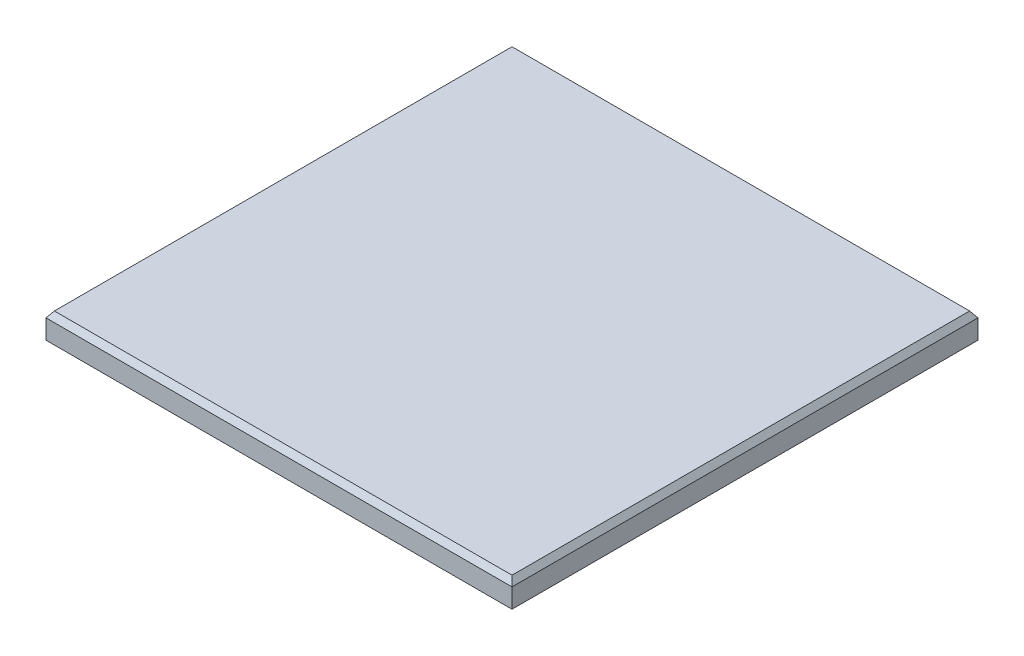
ISO-10303-21;
HEADER;
FILE_DESCRIPTION(('STEP AP214'),'2;1');
FILE_NAME('part.step','',(''),(''),'','','');
FILE_SCHEMA(('AUTOMOTIVE_DESIGN { 1 0 10303 214 1 1 1 1 }'));
ENDSEC;
DATA;
#1=APPLICATION_CONTEXT('core data for automotive mechanical design processes');
#2=APPLICATION_PROTOCOL_DEFINITION('international standard','automotive_design',2000,#1);
#3=PRODUCT_CONTEXT('',#1,'mechanical');
#4=PRODUCT('Part','Part','',(#3));
#5=PRODUCT_RELATED_PRODUCT_CATEGORY('part','',(#4));
#6=PRODUCT_DEFINITION_FORMATION('','',#4);
#7=PRODUCT_DEFINITION_CONTEXT('part definition',#1,'design');
#8=PRODUCT_DEFINITION('design','',#6,#7);
#9=PRODUCT_DEFINITION_SHAPE('','',#8);
#10=(LENGTH_UNIT() NAMED_UNIT(*) SI_UNIT(.MILLI.,.METRE.));
#11=(NAMED_UNIT(*) PLANE_ANGLE_UNIT() SI_UNIT($,.RADIAN.));
#12=(NAMED_UNIT(*) SI_UNIT($,.STERADIAN.) SOLID_ANGLE_UNIT());
#13=UNCERTAINTY_MEASURE_WITH_UNIT(LENGTH_MEASURE(1.E-05),#10,'distance_accuracy_value','');
#14=(GEOMETRIC_REPRESENTATION_CONTEXT(3) GLOBAL_UNCERTAINTY_ASSIGNED_CONTEXT((#13)) GLOBAL_UNIT_ASSIGNED_CONTEXT((#10,
#11,#12)) REPRESENTATION_CONTEXT('',''));
#15=CARTESIAN_POINT('',(0.,0.,0.));
#16=DIRECTION('',(0.,0.,1.));
#17=DIRECTION('',(1.,0.,0.));
#18=AXIS2_PLACEMENT_3D('',#15,#16,#17);
#19=CARTESIAN_POINT('',(-9.75,0.5,9.5));
#20=DIRECTION('',(0.,0.,-1.));
#21=DIRECTION('',(-1.,0.,0.));
#22=AXIS2_PLACEMENT_3D('',#19,#20,#21);
#23=PLANE('',#22);
#24=DIRECTION('',(0.,-1.,0.));
#25=VECTOR('',#24,1.);
#26=CARTESIAN_POINT('',(9.75,0.5,9.5));
#27=LINE('',#26,#25);
#28=CARTESIAN_POINT('',(9.75,0.25,9.5));
#29=VERTEX_POINT('',#28);
#30=CARTESIAN_POINT('',(9.75,-0.56,9.5));
#31=VERTEX_POINT('',#30);
#32=EDGE_CURVE('E122',#29,#31,#27,.T.);
#33=ORIENTED_EDGE('',*,*,#32,.F.);
#34=DIRECTION('',(-1.,0.,0.));
#35=VECTOR('',#34,1.);
#36=CARTESIAN_POINT('',(-9.75,0.25,9.5));
#37=LINE('',#36,#35);
#38=CARTESIAN_POINT('',(-9.75,0.25,9.5));
#39=VERTEX_POINT('',#38);
#40=EDGE_CURVE('E52',#29,#39,#37,.T.);
#41=ORIENTED_EDGE('',*,*,#40,.T.);
#42=DIRECTION('',(0.,-1.,0.));
#43=VECTOR('',#42,1.);
#44=CARTESIAN_POINT('',(-9.75,0.5,9.5));
#45=LINE('',#44,#43);
#46=CARTESIAN_POINT('',(-9.75,-0.56,9.5));
#47=VERTEX_POINT('',#46);
#48=EDGE_CURVE('E125',#39,#47,#45,.T.);
#49=ORIENTED_EDGE('',*,*,#48,.T.);
#50=DIRECTION('',(1.,0.,0.));
#51=VECTOR('',#50,1.);
#52=CARTESIAN_POINT('',(-9.75,-0.56,9.5));
#53=LINE('',#52,#51);
#54=EDGE_CURVE('E112',#47,#31,#53,.T.);
#55=ORIENTED_EDGE('',*,*,#54,.T.);
#56=EDGE_LOOP('',(#33,#41,#49,#55));
#57=FACE_BOUND('',#56,.T.);
#58=ADVANCED_FACE('F42',(#57),#23,.F.);
#59=CARTESIAN_POINT('',(-9.75,0.5,-10.));
#60=DIRECTION('',(0.,0.,1.));
#61=DIRECTION('',(1.,0.,0.));
#62=AXIS2_PLACEMENT_3D('',#59,#60,#61);
#63=PLANE('',#62);
#64=DIRECTION('',(0.,-1.,0.));
#65=VECTOR('',#64,1.);
#66=CARTESIAN_POINT('',(-9.75,0.5,-10.));
#67=LINE('',#66,#65);
#68=CARTESIAN_POINT('',(-9.75,0.25,-10.));
#69=VERTEX_POINT('',#68);
#70=CARTESIAN_POINT('',(-9.75,-0.56,-10.));
#71=VERTEX_POINT('',#70);
#72=EDGE_CURVE('E98',#69,#71,#67,.T.);
#73=ORIENTED_EDGE('',*,*,#72,.F.);
#74=DIRECTION('',(1.,0.,0.));
#75=VECTOR('',#74,1.);
#76=CARTESIAN_POINT('',(9.75,0.25,-10.));
#77=LINE('',#76,#75);
#78=CARTESIAN_POINT('',(9.75,0.25,-10.));
#79=VERTEX_POINT('',#78);
#80=EDGE_CURVE('E139',#69,#79,#77,.T.);
#81=ORIENTED_EDGE('',*,*,#80,.T.);
#82=DIRECTION('',(0.,-1.,0.));
#83=VECTOR('',#82,1.);
#84=CARTESIAN_POINT('',(9.75,0.5,-10.));
#85=LINE('',#84,#83);
#86=CARTESIAN_POINT('',(9.75,-0.56,-10.));
#87=VERTEX_POINT('',#86);
#88=EDGE_CURVE('E92',#79,#87,#85,.T.);
#89=ORIENTED_EDGE('',*,*,#88,.T.);
#90=DIRECTION('',(-1.,0.,0.));
#91=VECTOR('',#90,1.);
#92=CARTESIAN_POINT('',(-9.75,-0.56,-10.));
#93=LINE('',#92,#91);
#94=EDGE_CURVE('E46',#87,#71,#93,.T.);
#95=ORIENTED_EDGE('',*,*,#94,.T.);
#96=EDGE_LOOP('',(#73,#81,#89,#95));
#97=FACE_BOUND('',#96,.T.);
#98=ADVANCED_FACE('F106',(#97),#63,.F.);
#99=CARTESIAN_POINT('',(9.75,0.5,-9.75));
#100=DIRECTION('',(-1.,0.,0.));
#101=DIRECTION('',(0.,0.,1.));
#102=AXIS2_PLACEMENT_3D('',#99,#100,#101);
#103=PLANE('',#102);
#104=ORIENTED_EDGE('',*,*,#88,.F.);
#105=DIRECTION('',(0.,0.,1.));
#106=VECTOR('',#105,1.);
#107=CARTESIAN_POINT('',(9.75,0.25,9.75));
#108=LINE('',#107,#106);
#109=EDGE_CURVE('E124',#79,#29,#108,.T.);
#110=ORIENTED_EDGE('',*,*,#109,.T.);
#111=ORIENTED_EDGE('',*,*,#32,.T.);
#112=DIRECTION('',(0.,0.,-1.));
#113=VECTOR('',#112,1.);
#114=CARTESIAN_POINT('',(9.75,-0.56,-9.75));
#115=LINE('',#114,#113);
#116=EDGE_CURVE('E109',#31,#87,#115,.T.);
#117=ORIENTED_EDGE('',*,*,#116,.T.);
#118=EDGE_LOOP('',(#104,#110,#111,#117));
#119=FACE_BOUND('',#118,.T.);
#120=ADVANCED_FACE('F121',(#119),#103,.F.);
#121=CARTESIAN_POINT('',(-9.75,0.5,-9.75));
#122=DIRECTION('',(1.,0.,0.));
#123=DIRECTION('',(0.,0.,-1.));
#124=AXIS2_PLACEMENT_3D('',#121,#122,#123);
#125=PLANE('',#124);
#126=ORIENTED_EDGE('',*,*,#48,.F.);
#127=DIRECTION('',(0.,0.,-1.));
#128=VECTOR('',#127,1.);
#129=CARTESIAN_POINT('',(-9.75,0.25,-9.75));
#130=LINE('',#129,#128);
#131=EDGE_CURVE('E13',#39,#69,#130,.T.);
#132=ORIENTED_EDGE('',*,*,#131,.T.);
#133=ORIENTED_EDGE('',*,*,#72,.T.);
#134=DIRECTION('',(0.,0.,1.));
#135=VECTOR('',#134,1.);
#136=CARTESIAN_POINT('',(-9.75,-0.56,-9.75));
#137=LINE('',#136,#135);
#138=EDGE_CURVE('E101',#71,#47,#137,.T.);
#139=ORIENTED_EDGE('',*,*,#138,.T.);
#140=EDGE_LOOP('',(#126,#132,#133,#139));
#141=FACE_BOUND('',#140,.T.);
#142=ADVANCED_FACE('F99',(#141),#125,.F.);
#143=CARTESIAN_POINT('',(-9.75,0.5,9.75));
#144=DIRECTION('',(0.,1.,0.));
#145=DIRECTION('',(0.,0.,1.));
#146=AXIS2_PLACEMENT_3D('',#143,#144,#145);
#147=PLANE('',#146);
#148=DIRECTION('',(0.,0.,-1.));
#149=VECTOR('',#148,1.);
#150=CARTESIAN_POINT('',(9.57494811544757,0.5,-9.75));
#151=LINE('',#150,#149);
#152=CARTESIAN_POINT('',(9.57494811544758,0.5,9.32494811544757));
#153=VERTEX_POINT('',#152);
#154=CARTESIAN_POINT('',(9.57494811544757,0.5,-9.82494811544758));
#155=VERTEX_POINT('',#154);
#156=EDGE_CURVE('E137',#153,#155,#151,.T.);
#157=ORIENTED_EDGE('',*,*,#156,.T.);
#158=DIRECTION('',(-1.,0.,0.));
#159=VECTOR('',#158,1.);
#160=CARTESIAN_POINT('',(-9.75,0.5,-9.82494811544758));
#161=LINE('',#160,#159);
#162=CARTESIAN_POINT('',(-9.57494811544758,0.5,-9.82494811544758));
#163=VERTEX_POINT('',#162);
#164=EDGE_CURVE('E141',#155,#163,#161,.T.);
#165=ORIENTED_EDGE('',*,*,#164,.T.);
#166=DIRECTION('',(0.,0.,1.));
#167=VECTOR('',#166,1.);
#168=CARTESIAN_POINT('',(-9.57494811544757,0.5,9.75));
#169=LINE('',#168,#167);
#170=CARTESIAN_POINT('',(-9.57494811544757,0.5,9.32494811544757));
#171=VERTEX_POINT('',#170);
#172=EDGE_CURVE('E128',#163,#171,#169,.T.);
#173=ORIENTED_EDGE('',*,*,#172,.T.);
#174=DIRECTION('',(1.,0.,0.));
#175=VECTOR('',#174,1.);
#176=CARTESIAN_POINT('',(9.75,0.5,9.32494811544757));
#177=LINE('',#176,#175);
#178=EDGE_CURVE('E130',#171,#153,#177,.T.);
#179=ORIENTED_EDGE('',*,*,#178,.T.);
#180=EDGE_LOOP('',(#157,#165,#173,#179));
#181=FACE_BOUND('',#180,.T.);
#182=ADVANCED_FACE('F155',(#181),#147,.T.);
#183=CARTESIAN_POINT('',(-9.75,-0.56,9.75));
#184=DIRECTION('',(0.,1.,0.));
#185=DIRECTION('',(0.,0.,1.));
#186=AXIS2_PLACEMENT_3D('',#183,#184,#185);
#187=PLANE('',#186);
#188=ORIENTED_EDGE('',*,*,#138,.F.);
#189=ORIENTED_EDGE('',*,*,#94,.F.);
#190=ORIENTED_EDGE('',*,*,#116,.F.);
#191=ORIENTED_EDGE('',*,*,#54,.F.);
#192=EDGE_LOOP('',(#188,#189,#190,#191));
#193=FACE_BOUND('',#192,.T.);
#194=ADVANCED_FACE('F44',(#193),#187,.F.);
#195=CARTESIAN_POINT('',(-9.75,0.5,9.32494811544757));
#196=DIRECTION('',(0.,0.573576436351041,0.819152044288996));
#197=DIRECTION('',(0.,-0.819152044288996,0.573576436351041));
#198=AXIS2_PLACEMENT_3D('',#195,#196,#197);
#199=PLANE('',#198);
#200=DIRECTION('',(0.497542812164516,0.710564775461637,-0.497542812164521));
#201=VECTOR('',#200,1.);
#202=CARTESIAN_POINT('',(-9.61828200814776,0.438112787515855,9.36828200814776));
#203=LINE('',#202,#201);
#204=EDGE_CURVE('E117',#39,#171,#203,.T.);
#205=ORIENTED_EDGE('',*,*,#204,.F.);
#206=ORIENTED_EDGE('',*,*,#40,.F.);
#207=DIRECTION('',(-0.497542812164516,0.710564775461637,-0.49754281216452));
#208=VECTOR('',#207,1.);
#209=CARTESIAN_POINT('',(4.79107943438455,7.33207252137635,4.54107943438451));
#210=LINE('',#209,#208);
#211=EDGE_CURVE('E113',#153,#29,#210,.F.);
#212=ORIENTED_EDGE('',*,*,#211,.F.);
#213=ORIENTED_EDGE('',*,*,#178,.F.);
#214=EDGE_LOOP('',(#205,#206,#212,#213));
#215=FACE_BOUND('',#214,.T.);
#216=ADVANCED_FACE('F164',(#215),#199,.T.);
#217=CARTESIAN_POINT('',(9.57494811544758,0.5,9.75));
#218=DIRECTION('',(0.819152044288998,0.573576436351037,0.));
#219=DIRECTION('',(-0.573576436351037,0.819152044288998,0.));
#220=AXIS2_PLACEMENT_3D('',#217,#218,#219);
#221=PLANE('',#220);
#222=ORIENTED_EDGE('',*,*,#211,.T.);
#223=ORIENTED_EDGE('',*,*,#109,.F.);
#224=DIRECTION('',(-0.497542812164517,0.710564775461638,0.497542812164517));
#225=VECTOR('',#224,1.);
#226=CARTESIAN_POINT('',(4.79107943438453,7.33207252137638,-5.04107943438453));
#227=LINE('',#226,#225);
#228=EDGE_CURVE('E136',#155,#79,#227,.F.);
#229=ORIENTED_EDGE('',*,*,#228,.F.);
#230=ORIENTED_EDGE('',*,*,#156,.F.);
#231=EDGE_LOOP('',(#222,#223,#229,#230));
#232=FACE_BOUND('',#231,.T.);
#233=ADVANCED_FACE('F161',(#232),#221,.T.);
#234=CARTESIAN_POINT('',(-9.57494811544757,0.5,9.75));
#235=DIRECTION('',(-0.819152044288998,0.573576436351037,0.));
#236=DIRECTION('',(-0.573576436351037,-0.819152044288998,0.));
#237=AXIS2_PLACEMENT_3D('',#234,#235,#236);
#238=PLANE('',#237);
#239=ORIENTED_EDGE('',*,*,#204,.T.);
#240=ORIENTED_EDGE('',*,*,#172,.F.);
#241=DIRECTION('',(-0.497542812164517,-0.710564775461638,-0.497542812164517));
#242=VECTOR('',#241,1.);
#243=CARTESIAN_POINT('',(-4.79107943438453,7.33207252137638,-5.04107943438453));
#244=LINE('',#243,#242);
#245=EDGE_CURVE('E143',#69,#163,#244,.F.);
#246=ORIENTED_EDGE('',*,*,#245,.F.);
#247=ORIENTED_EDGE('',*,*,#131,.F.);
#248=EDGE_LOOP('',(#239,#240,#246,#247));
#249=FACE_BOUND('',#248,.T.);
#250=ADVANCED_FACE('F152',(#249),#238,.T.);
#251=CARTESIAN_POINT('',(-9.75,0.5,-9.82494811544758));
#252=DIRECTION('',(0.,0.573576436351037,-0.819152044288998));
#253=DIRECTION('',(0.,0.819152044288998,0.573576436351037));
#254=AXIS2_PLACEMENT_3D('',#251,#252,#253);
#255=PLANE('',#254);
#256=ORIENTED_EDGE('',*,*,#228,.T.);
#257=ORIENTED_EDGE('',*,*,#80,.F.);
#258=ORIENTED_EDGE('',*,*,#245,.T.);
#259=ORIENTED_EDGE('',*,*,#164,.F.);
#260=EDGE_LOOP('',(#256,#257,#258,#259));
#261=FACE_BOUND('',#260,.T.);
#262=ADVANCED_FACE('F150',(#261),#255,.T.);
#263=CLOSED_SHELL('',(#58,#98,#120,#142,#182,#194,#216,#233,#250,#262));
#264=MANIFOLD_SOLID_BREP('B2',#263);
#265=ADVANCED_BREP_SHAPE_REPRESENTATION('',(#18,#264),#14);
#266=SHAPE_DEFINITION_REPRESENTATION(#9,#265);
ENDSEC;
END-ISO-10303-21;
